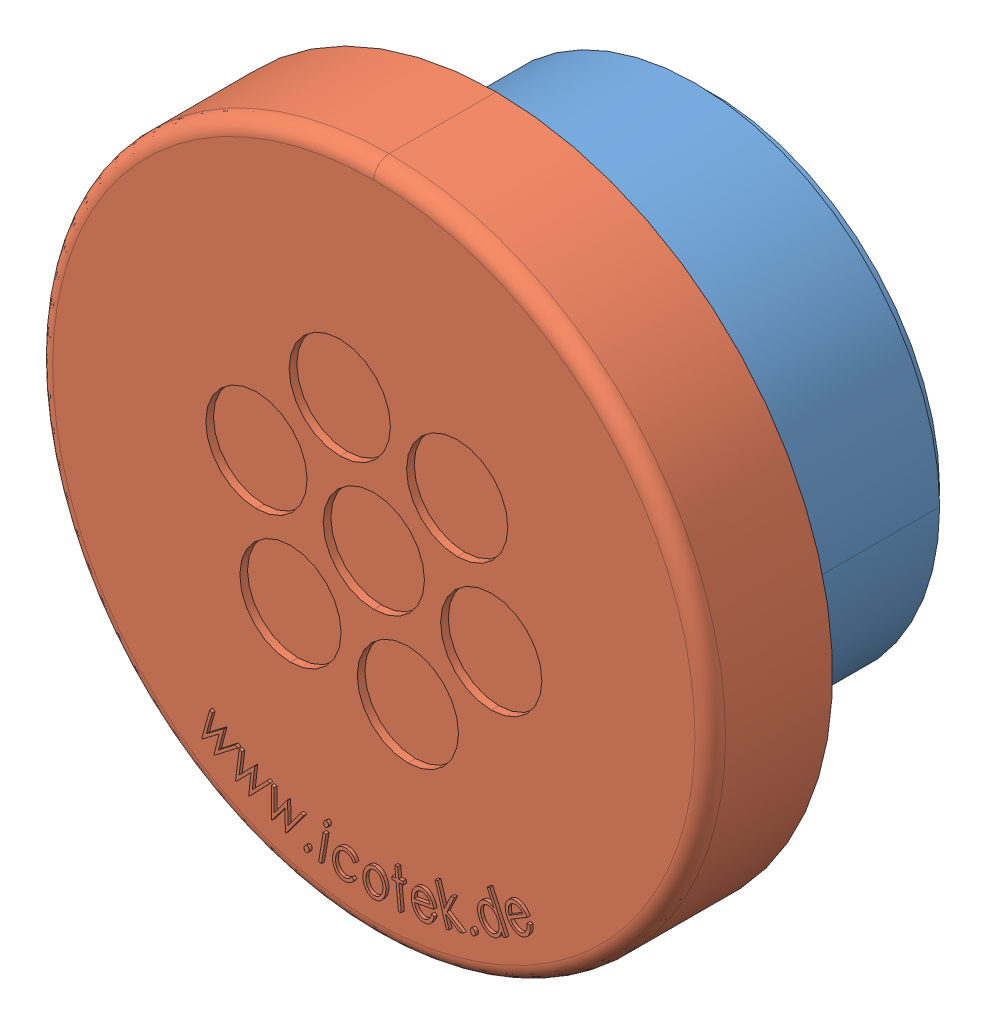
SolidWorks assembly 43734.SLDASM, configuration Default (file format 8000). Lengths in mm.
Overall size (44 44 22.2).
2 component instances, 2 part files, 0 mates.
Components (placement in the parent):
- 43734_01-1: 43734_01.SLDPRT [Default] at origin size (32 32 14)
- 43734_02-1: 43734_02.SLDPRT [Default] at origin size (44 44 8.2)
